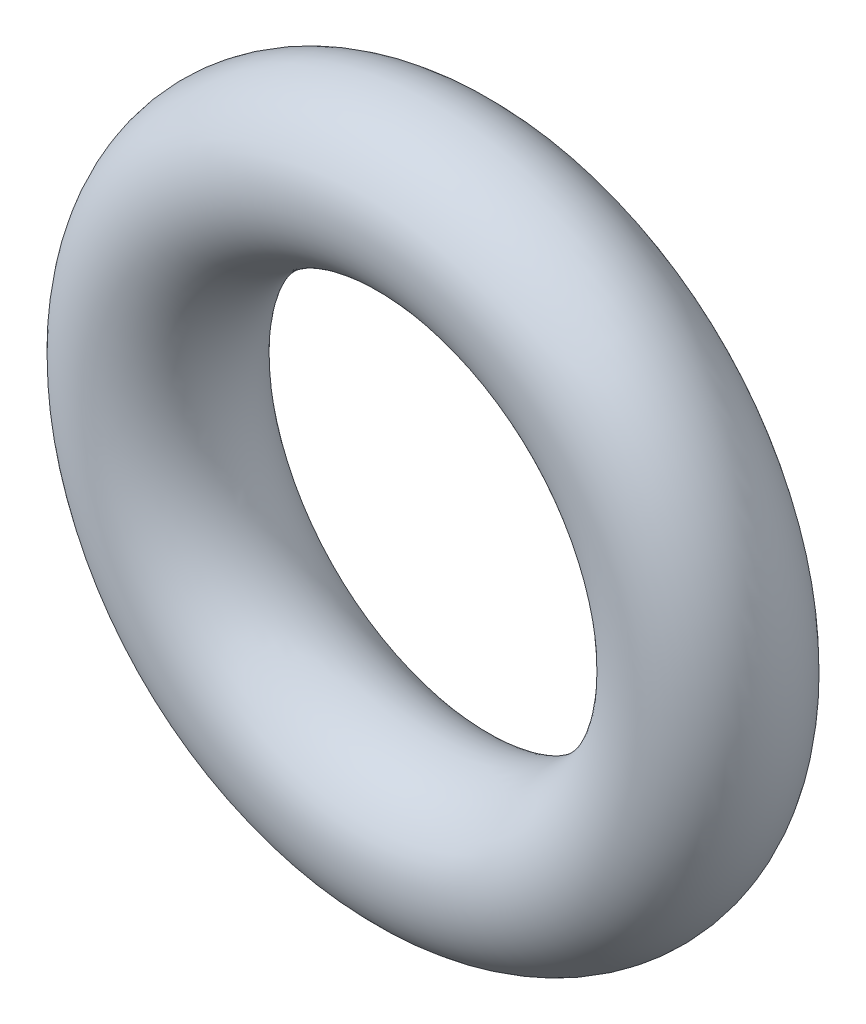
from build123d import *

# Parameters (mm, degrees)
SKETCH1_R = 0.5


with BuildPart() as part:
    # Sketch1 → Revolve1 (revolve)
    with BuildSketch(Plane(origin=(0, 0, 0), x_dir=(0, -1, 0), z_dir=(1, 0, 0)), mode=Mode.PRIVATE) as revolve1_sk:
        with Locations((1.75, 0)):
            Circle(SKETCH1_R)
    revolve(revolve1_sk.sketch.rotate(Axis((0, 0, 0.5), (0, 0, -1)), 270), axis=Axis((0, 0, 0.5), (0, 0, -1)))


solid = part.part
